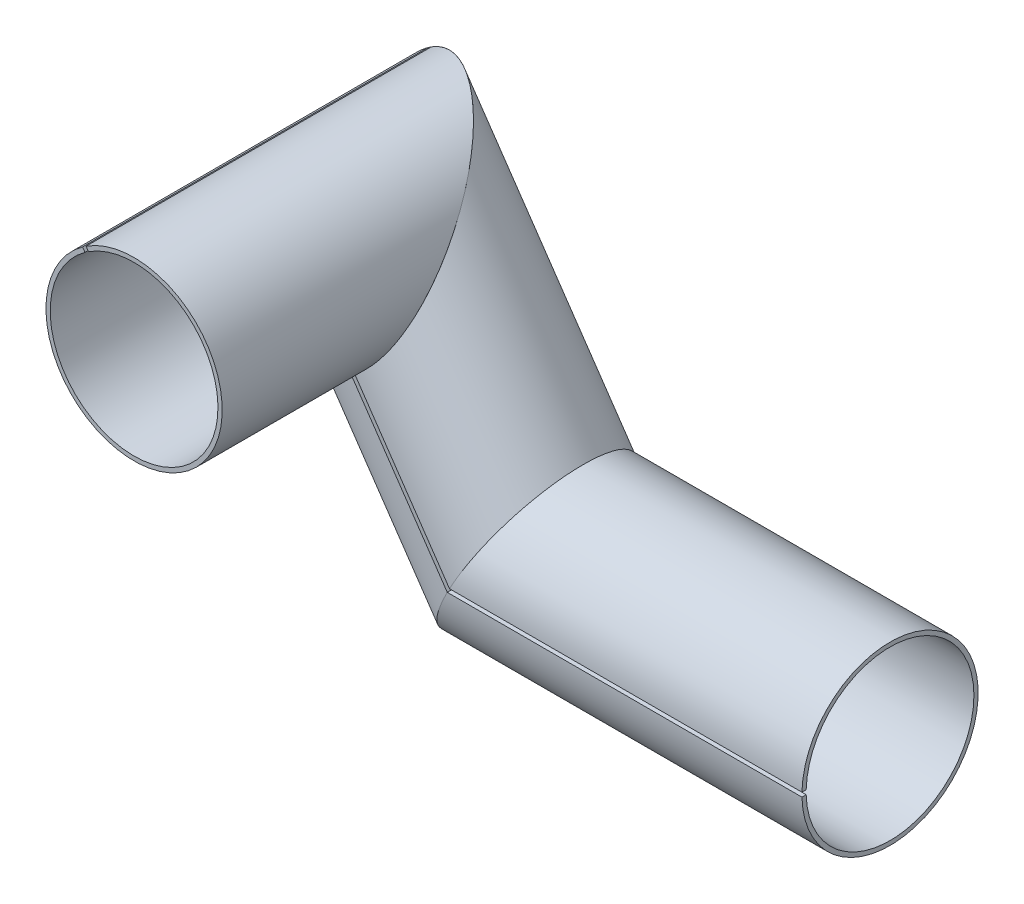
ISO-10303-21;
HEADER;
FILE_DESCRIPTION(('STEP AP214'),'2;1');
FILE_NAME('part.step','',(''),(''),'','','');
FILE_SCHEMA(('AUTOMOTIVE_DESIGN { 1 0 10303 214 1 1 1 1 }'));
ENDSEC;
DATA;
#1=APPLICATION_CONTEXT('core data for automotive mechanical design processes');
#2=APPLICATION_PROTOCOL_DEFINITION('international standard','automotive_design',2000,#1);
#3=PRODUCT_CONTEXT('',#1,'mechanical');
#4=PRODUCT('Part','Part','',(#3));
#5=PRODUCT_RELATED_PRODUCT_CATEGORY('part','',(#4));
#6=PRODUCT_DEFINITION_FORMATION('','',#4);
#7=PRODUCT_DEFINITION_CONTEXT('part definition',#1,'design');
#8=PRODUCT_DEFINITION('design','',#6,#7);
#9=PRODUCT_DEFINITION_SHAPE('','',#8);
#10=(LENGTH_UNIT() NAMED_UNIT(*) SI_UNIT(.MILLI.,.METRE.));
#11=(NAMED_UNIT(*) PLANE_ANGLE_UNIT() SI_UNIT($,.RADIAN.));
#12=(NAMED_UNIT(*) SI_UNIT($,.STERADIAN.) SOLID_ANGLE_UNIT());
#13=UNCERTAINTY_MEASURE_WITH_UNIT(LENGTH_MEASURE(1.E-05),#10,'distance_accuracy_value','');
#14=(GEOMETRIC_REPRESENTATION_CONTEXT(3) GLOBAL_UNCERTAINTY_ASSIGNED_CONTEXT((#13)) GLOBAL_UNIT_ASSIGNED_CONTEXT((#10,
#11,#12)) REPRESENTATION_CONTEXT('',''));
#15=CARTESIAN_POINT('',(0.,0.,0.));
#16=DIRECTION('',(0.,0.,1.));
#17=DIRECTION('',(1.,0.,0.));
#18=AXIS2_PLACEMENT_3D('',#15,#16,#17);
#19=CARTESIAN_POINT('',(-34.2580416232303,50.053168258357,60.65420899));
#20=DIRECTION('',(0.,0.,1.));
#21=DIRECTION('',(1.,0.,0.));
#22=AXIS2_PLACEMENT_3D('',#19,#20,#21);
#23=PLANE('',#22);
#24=DIRECTION('',(0.564808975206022,-0.825221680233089,0.));
#25=VECTOR('',#24,1.);
#26=CARTESIAN_POINT('',(-50.98980177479,73.6140743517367,60.65420899));
#27=LINE('',#26,#25);
#28=CARTESIAN_POINT('',(-46.4073916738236,66.9188830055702,60.65420899));
#29=VERTEX_POINT('',#28);
#30=CARTESIAN_POINT('',(-45.8424109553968,66.0934103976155,60.65420899));
#31=VERTEX_POINT('',#30);
#32=EDGE_CURVE('E124',#29,#31,#27,.T.);
#33=ORIENTED_EDGE('',*,*,#32,.F.);
#34=CARTESIAN_POINT('',(-34.2580416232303,50.053168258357,60.65420899));
#35=DIRECTION('',(0.,0.,1.));
#36=DIRECTION('',(1.,0.,0.));
#37=AXIS2_PLACEMENT_3D('',#34,#35,#36);
#38=CIRCLE('',#37,20.786029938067);
#39=CARTESIAN_POINT('',(-45.5821699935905,67.4836919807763,60.65420899));
#40=VERTEX_POINT('',#39);
#41=EDGE_CURVE('E130',#29,#40,#38,.T.);
#42=ORIENTED_EDGE('',*,*,#41,.T.);
#43=DIRECTION('',(0.564808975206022,-0.825221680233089,0.));
#44=VECTOR('',#43,1.);
#45=CARTESIAN_POINT('',(-50.1645800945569,74.1788833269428,60.65420899));
#46=LINE('',#45,#44);
#47=CARTESIAN_POINT('',(-45.0171892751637,66.6582193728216,60.65420899));
#48=VERTEX_POINT('',#47);
#49=EDGE_CURVE('E116',#40,#48,#46,.T.);
#50=ORIENTED_EDGE('',*,*,#49,.T.);
#51=CARTESIAN_POINT('',(-34.2580416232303,50.053168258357,60.65420899));
#52=DIRECTION('',(0.,0.,1.));
#53=DIRECTION('',(1.,0.,0.));
#54=AXIS2_PLACEMENT_3D('',#51,#52,#53);
#55=CIRCLE('',#54,19.786029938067);
#56=EDGE_CURVE('E136',#31,#48,#55,.T.);
#57=ORIENTED_EDGE('',*,*,#56,.F.);
#58=EDGE_LOOP('',(#33,#42,#50,#57));
#59=FACE_BOUND('',#58,.T.);
#60=ADVANCED_FACE('F78',(#59),#23,.T.);
#61=CARTESIAN_POINT('',(-34.2580416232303,50.053168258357,60.65420899));
#62=DIRECTION('',(0.,0.,-1.));
#63=DIRECTION('',(-1.,0.,0.));
#64=AXIS2_PLACEMENT_3D('',#61,#62,#63);
#65=CYLINDRICAL_SURFACE('',#64,20.786029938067);
#66=ORIENTED_EDGE('',*,*,#41,.F.);
#67=DIRECTION('',(0.,0.,-1.));
#68=VECTOR('',#67,1.);
#69=CARTESIAN_POINT('',(-46.4073916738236,66.9188830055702,60.65420899));
#70=LINE('',#69,#68);
#71=CARTESIAN_POINT('',(-46.4073916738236,66.9188830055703,-20.7800154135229));
#72=VERTEX_POINT('',#71);
#73=EDGE_CURVE('E149',#29,#72,#70,.T.);
#74=ORIENTED_EDGE('',*,*,#73,.T.);
#75=CARTESIAN_POINT('',(-34.2580416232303,50.053168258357,-3.7470027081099E-13));
#76=DIRECTION('',(-0.399380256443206,0.583519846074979,0.707106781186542));
#77=DIRECTION('',(-0.399380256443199,0.583519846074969,-0.707106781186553));
#78=AXIS2_PLACEMENT_3D('',#75,#76,#77);
#79=ELLIPSE('',#78,29.3958854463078,20.786029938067);
#80=CARTESIAN_POINT('',(-45.5821699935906,67.4836919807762,-20.7800154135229));
#81=VERTEX_POINT('',#80);
#82=EDGE_CURVE('E132',#72,#81,#79,.T.);
#83=ORIENTED_EDGE('',*,*,#82,.T.);
#84=DIRECTION('',(0.,0.,-1.));
#85=VECTOR('',#84,1.);
#86=CARTESIAN_POINT('',(-45.5821699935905,67.4836919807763,60.65420899));
#87=LINE('',#86,#85);
#88=EDGE_CURVE('E93',#40,#81,#87,.T.);
#89=ORIENTED_EDGE('',*,*,#88,.F.);
#90=EDGE_LOOP('',(#66,#74,#83,#89));
#91=FACE_BOUND('',#90,.T.);
#92=ADVANCED_FACE('F80',(#91),#65,.T.);
#93=CARTESIAN_POINT('',(-34.2580416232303,50.053168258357,60.65420899));
#94=DIRECTION('',(0.,0.,-1.));
#95=DIRECTION('',(-1.,0.,0.));
#96=AXIS2_PLACEMENT_3D('',#93,#94,#95);
#97=CYLINDRICAL_SURFACE('',#96,19.786029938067);
#98=DIRECTION('',(0.,0.,-1.));
#99=VECTOR('',#98,1.);
#100=CARTESIAN_POINT('',(-45.8424109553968,66.0934103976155,60.65420899));
#101=LINE('',#100,#99);
#102=CARTESIAN_POINT('',(-45.8424109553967,66.0934103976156,-19.7797113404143));
#103=VERTEX_POINT('',#102);
#104=EDGE_CURVE('E101',#31,#103,#101,.T.);
#105=ORIENTED_EDGE('',*,*,#104,.F.);
#106=ORIENTED_EDGE('',*,*,#56,.T.);
#107=DIRECTION('',(0.,0.,-1.));
#108=VECTOR('',#107,1.);
#109=CARTESIAN_POINT('',(-45.0171892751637,66.6582193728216,60.65420899));
#110=LINE('',#109,#108);
#111=CARTESIAN_POINT('',(-45.0171892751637,66.6582193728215,-19.7797113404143));
#112=VERTEX_POINT('',#111);
#113=EDGE_CURVE('E119',#48,#112,#110,.T.);
#114=ORIENTED_EDGE('',*,*,#113,.T.);
#115=CARTESIAN_POINT('',(-34.2580416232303,50.053168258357,-3.7470027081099E-13));
#116=DIRECTION('',(-0.399380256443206,0.583519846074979,0.707106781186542));
#117=DIRECTION('',(-0.399380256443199,0.583519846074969,-0.707106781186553));
#118=AXIS2_PLACEMENT_3D('',#115,#116,#117);
#119=ELLIPSE('',#118,27.9816718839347,19.786029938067);
#120=EDGE_CURVE('E135',#103,#112,#119,.T.);
#121=ORIENTED_EDGE('',*,*,#120,.F.);
#122=EDGE_LOOP('',(#105,#106,#114,#121));
#123=FACE_BOUND('',#122,.T.);
#124=ADVANCED_FACE('F145',(#123),#97,.F.);
#125=CARTESIAN_POINT('',(261.71806413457,179.128487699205,60.6542089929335));
#126=DIRECTION('',(-0.399380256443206,0.583519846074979,0.707106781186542));
#127=DIRECTION('',(0.,-0.771289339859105,0.636484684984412));
#128=AXIS2_PLACEMENT_3D('',#125,#126,#127);
#129=PLANE('',#128);
#130=ORIENTED_EDGE('',*,*,#82,.F.);
#131=DIRECTION('',(0.3993802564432,-0.583519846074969,0.707106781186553));
#132=VECTOR('',#131,1.);
#133=CARTESIAN_POINT('',(-0.412610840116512,-0.282404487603,60.6542089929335));
#134=LINE('',#133,#132);
#135=EDGE_CURVE('E13',#72,#103,#134,.T.);
#136=ORIENTED_EDGE('',*,*,#135,.T.);
#137=ORIENTED_EDGE('',*,*,#120,.T.);
#138=DIRECTION('',(0.3993802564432,-0.583519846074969,0.707106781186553));
#139=VECTOR('',#138,1.);
#140=CARTESIAN_POINT('',(0.412610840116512,0.282404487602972,60.6542089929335));
#141=LINE('',#140,#139);
#142=EDGE_CURVE('E86',#81,#112,#141,.T.);
#143=ORIENTED_EDGE('',*,*,#142,.F.);
#144=EDGE_LOOP('',(#130,#136,#137,#143));
#145=FACE_BOUND('',#144,.T.);
#146=ADVANCED_FACE('F147',(#145),#129,.F.);
#147=CARTESIAN_POINT('',(-50.1645800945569,74.1788833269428,0.));
#148=DIRECTION('',(-0.825221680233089,-0.564808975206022,0.));
#149=DIRECTION('',(0.564808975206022,-0.825221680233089,0.));
#150=AXIS2_PLACEMENT_3D('',#147,#148,#149);
#151=PLANE('',#150);
#152=ORIENTED_EDGE('',*,*,#88,.T.);
#153=ORIENTED_EDGE('',*,*,#142,.T.);
#154=ORIENTED_EDGE('',*,*,#113,.F.);
#155=ORIENTED_EDGE('',*,*,#49,.F.);
#156=EDGE_LOOP('',(#152,#153,#154,#155));
#157=FACE_BOUND('',#156,.T.);
#158=ADVANCED_FACE('F117',(#157),#151,.T.);
#159=CARTESIAN_POINT('',(-50.98980177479,73.6140743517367,0.));
#160=DIRECTION('',(-0.825221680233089,-0.564808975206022,0.));
#161=DIRECTION('',(0.564808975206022,-0.825221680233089,0.));
#162=AXIS2_PLACEMENT_3D('',#159,#160,#161);
#163=PLANE('',#162);
#164=ORIENTED_EDGE('',*,*,#32,.T.);
#165=ORIENTED_EDGE('',*,*,#104,.T.);
#166=ORIENTED_EDGE('',*,*,#135,.F.);
#167=ORIENTED_EDGE('',*,*,#73,.F.);
#168=EDGE_LOOP('',(#164,#165,#166,#167));
#169=FACE_BOUND('',#168,.T.);
#170=ADVANCED_FACE('F148',(#169),#163,.F.);
#171=CLOSED_SHELL('',(#60,#92,#124,#146,#158,#170));
#172=MANIFOLD_SOLID_BREP('B2',#171);
#173=CARTESIAN_POINT('',(6.19130841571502,-9.04589367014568,0.));
#174=DIRECTION('',(-0.564808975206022,0.825221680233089,0.));
#175=DIRECTION('',(-0.82522168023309,-0.564808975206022,0.));
#176=AXIS2_PLACEMENT_3D('',#173,#174,#175);
#177=CYLINDRICAL_SURFACE('',#176,20.786029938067);
#178=CARTESIAN_POINT('',(-34.2580416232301,50.0531682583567,0.));
#179=DIRECTION('',(-0.399380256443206,0.583519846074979,0.707106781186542));
#180=DIRECTION('',(-0.399380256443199,0.583519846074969,-0.707106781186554));
#181=AXIS2_PLACEMENT_3D('',#178,#179,#180);
#182=ELLIPSE('',#181,29.3958854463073,20.786029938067);
#183=CARTESIAN_POINT('',(-22.1086915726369,33.1874535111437,20.7800154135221));
#184=VERTEX_POINT('',#183);
#185=CARTESIAN_POINT('',(-22.93391325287,32.6226445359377,20.7800154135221));
#186=VERTEX_POINT('',#185);
#187=EDGE_CURVE('E276',#184,#186,#182,.T.);
#188=ORIENTED_EDGE('',*,*,#187,.F.);
#189=DIRECTION('',(-0.564808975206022,0.825221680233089,0.));
#190=VECTOR('',#189,1.);
#191=CARTESIAN_POINT('',(6.60391925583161,-8.76348918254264,20.7800154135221));
#192=LINE('',#191,#190);
#193=CARTESIAN_POINT('',(0.263681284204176,0.5,20.7800154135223));
#194=VERTEX_POINT('',#193);
#195=EDGE_CURVE('E230',#184,#194,#192,.F.);
#196=ORIENTED_EDGE('',*,*,#195,.T.);
#197=CARTESIAN_POINT('',(0.,0.,0.));
#198=DIRECTION('',(-0.88453631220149,0.46647134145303,0.));
#199=DIRECTION('',(0.46647134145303,0.88453631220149,0.));
#200=AXIS2_PLACEMENT_3D('',#197,#198,#199);
#201=ELLIPSE('',#200,23.499351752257,20.786029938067);
#202=CARTESIAN_POINT('',(-0.263681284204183,-0.5,20.7800154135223));
#203=VERTEX_POINT('',#202);
#204=EDGE_CURVE('E269',#194,#203,#201,.T.);
#205=ORIENTED_EDGE('',*,*,#204,.T.);
#206=DIRECTION('',(-0.564808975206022,0.825221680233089,0.));
#207=VECTOR('',#206,1.);
#208=CARTESIAN_POINT('',(5.77869757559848,-9.32829815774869,20.7800154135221));
#209=LINE('',#208,#207);
#210=EDGE_CURVE('E254',#186,#203,#209,.F.);
#211=ORIENTED_EDGE('',*,*,#210,.F.);
#212=EDGE_LOOP('',(#188,#196,#205,#211));
#213=FACE_BOUND('',#212,.T.);
#214=ADVANCED_FACE('F217',(#213),#177,.T.);
#215=CARTESIAN_POINT('',(6.19130841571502,-9.04589367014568,0.));
#216=DIRECTION('',(-0.564808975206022,0.825221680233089,0.));
#217=DIRECTION('',(-0.82522168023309,-0.564808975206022,0.));
#218=AXIS2_PLACEMENT_3D('',#215,#216,#217);
#219=CYLINDRICAL_SURFACE('',#218,19.786029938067);
#220=DIRECTION('',(-0.564808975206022,0.825221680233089,0.));
#221=VECTOR('',#220,1.);
#222=CARTESIAN_POINT('',(6.60391925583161,-8.76348918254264,19.7797113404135));
#223=LINE('',#222,#221);
#224=CARTESIAN_POINT('',(-22.6736722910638,34.0129261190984,19.7797113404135));
#225=VERTEX_POINT('',#224);
#226=CARTESIAN_POINT('',(0.263681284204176,0.5,19.7797113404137));
#227=VERTEX_POINT('',#226);
#228=EDGE_CURVE('E262',#225,#227,#223,.F.);
#229=ORIENTED_EDGE('',*,*,#228,.F.);
#230=CARTESIAN_POINT('',(-34.2580416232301,50.0531682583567,0.));
#231=DIRECTION('',(-0.399380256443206,0.583519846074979,0.707106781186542));
#232=DIRECTION('',(-0.399380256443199,0.583519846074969,-0.707106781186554));
#233=AXIS2_PLACEMENT_3D('',#230,#231,#232);
#234=ELLIPSE('',#233,27.9816718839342,19.786029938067);
#235=CARTESIAN_POINT('',(-23.4988939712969,33.4481171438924,19.7797113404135));
#236=VERTEX_POINT('',#235);
#237=EDGE_CURVE('E274',#225,#236,#234,.T.);
#238=ORIENTED_EDGE('',*,*,#237,.T.);
#239=DIRECTION('',(-0.564808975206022,0.825221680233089,0.));
#240=VECTOR('',#239,1.);
#241=CARTESIAN_POINT('',(5.77869757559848,-9.32829815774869,19.7797113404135));
#242=LINE('',#241,#240);
#243=CARTESIAN_POINT('',(-0.263681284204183,-0.5,19.7797113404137));
#244=VERTEX_POINT('',#243);
#245=EDGE_CURVE('E238',#236,#244,#242,.F.);
#246=ORIENTED_EDGE('',*,*,#245,.T.);
#247=CARTESIAN_POINT('',(0.,0.,0.));
#248=DIRECTION('',(-0.88453631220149,0.46647134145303,0.));
#249=DIRECTION('',(0.46647134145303,0.88453631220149,0.));
#250=AXIS2_PLACEMENT_3D('',#247,#248,#249);
#251=ELLIPSE('',#250,22.3688159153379,19.786029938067);
#252=EDGE_CURVE('E271',#227,#244,#251,.T.);
#253=ORIENTED_EDGE('',*,*,#252,.F.);
#254=EDGE_LOOP('',(#229,#238,#246,#253));
#255=FACE_BOUND('',#254,.T.);
#256=ADVANCED_FACE('F288',(#255),#219,.F.);
#257=CARTESIAN_POINT('',(-10.9617741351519,-20.786029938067,329.872407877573));
#258=DIRECTION('',(-0.88453631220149,0.46647134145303,0.));
#259=DIRECTION('',(-0.46647134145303,-0.88453631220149,0.));
#260=AXIS2_PLACEMENT_3D('',#257,#258,#259);
#261=PLANE('',#260);
#262=ORIENTED_EDGE('',*,*,#204,.F.);
#263=DIRECTION('',(0.,0.,-1.));
#264=VECTOR('',#263,1.);
#265=CARTESIAN_POINT('',(0.263681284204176,0.5,60.65420899));
#266=LINE('',#265,#264);
#267=EDGE_CURVE('E272',#194,#227,#266,.T.);
#268=ORIENTED_EDGE('',*,*,#267,.T.);
#269=ORIENTED_EDGE('',*,*,#252,.T.);
#270=DIRECTION('',(0.,0.,-1.));
#271=VECTOR('',#270,1.);
#272=CARTESIAN_POINT('',(-0.263681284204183,-0.5,60.65420899));
#273=LINE('',#272,#271);
#274=EDGE_CURVE('E257',#203,#244,#273,.T.);
#275=ORIENTED_EDGE('',*,*,#274,.F.);
#276=EDGE_LOOP('',(#262,#268,#269,#275));
#277=FACE_BOUND('',#276,.T.);
#278=ADVANCED_FACE('F267',(#277),#261,.F.);
#279=CARTESIAN_POINT('',(280.632861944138,192.074400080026,60.6542089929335));
#280=DIRECTION('',(-0.399380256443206,0.583519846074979,0.707106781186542));
#281=DIRECTION('',(0.,-0.771289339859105,0.636484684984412));
#282=AXIS2_PLACEMENT_3D('',#279,#280,#281);
#283=PLANE('',#282);
#284=DIRECTION('',(-0.3993802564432,0.583519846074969,-0.707106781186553));
#285=VECTOR('',#284,1.);
#286=CARTESIAN_POINT('',(0.412610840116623,0.282404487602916,60.6542089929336));
#287=LINE('',#286,#285);
#288=EDGE_CURVE('E76',#184,#225,#287,.T.);
#289=ORIENTED_EDGE('',*,*,#288,.F.);
#290=ORIENTED_EDGE('',*,*,#187,.T.);
#291=DIRECTION('',(-0.399380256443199,0.583519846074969,-0.707106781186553));
#292=VECTOR('',#291,1.);
#293=CARTESIAN_POINT('',(-0.412610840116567,-0.282404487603,60.6542089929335));
#294=LINE('',#293,#292);
#295=EDGE_CURVE('E224',#186,#236,#294,.T.);
#296=ORIENTED_EDGE('',*,*,#295,.T.);
#297=ORIENTED_EDGE('',*,*,#237,.F.);
#298=EDGE_LOOP('',(#289,#290,#296,#297));
#299=FACE_BOUND('',#298,.T.);
#300=ADVANCED_FACE('F284',(#299),#283,.T.);
#301=CARTESIAN_POINT('',(-34.6706524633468,49.770763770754,60.65420899));
#302=DIRECTION('',(0.825221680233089,0.564808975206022,0.));
#303=DIRECTION('',(-0.564808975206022,0.825221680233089,0.));
#304=AXIS2_PLACEMENT_3D('',#301,#302,#303);
#305=PLANE('',#304);
#306=ORIENTED_EDGE('',*,*,#210,.T.);
#307=ORIENTED_EDGE('',*,*,#274,.T.);
#308=ORIENTED_EDGE('',*,*,#245,.F.);
#309=ORIENTED_EDGE('',*,*,#295,.F.);
#310=EDGE_LOOP('',(#306,#307,#308,#309));
#311=FACE_BOUND('',#310,.T.);
#312=ADVANCED_FACE('F256',(#311),#305,.T.);
#313=CARTESIAN_POINT('',(-33.8454307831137,50.33557274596,60.65420899));
#314=DIRECTION('',(0.825221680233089,0.564808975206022,0.));
#315=DIRECTION('',(-0.564808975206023,0.825221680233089,0.));
#316=AXIS2_PLACEMENT_3D('',#313,#314,#315);
#317=PLANE('',#316);
#318=ORIENTED_EDGE('',*,*,#288,.T.);
#319=ORIENTED_EDGE('',*,*,#228,.T.);
#320=ORIENTED_EDGE('',*,*,#267,.F.);
#321=ORIENTED_EDGE('',*,*,#195,.F.);
#322=EDGE_LOOP('',(#318,#319,#320,#321));
#323=FACE_BOUND('',#322,.T.);
#324=ADVANCED_FACE('F286',(#323),#317,.F.);
#325=CLOSED_SHELL('',(#214,#256,#278,#300,#312,#324));
#326=MANIFOLD_SOLID_BREP('B7',#325);
#327=CARTESIAN_POINT('',(83.3860984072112,0.,0.));
#328=DIRECTION('',(-1.,0.,0.));
#329=DIRECTION('',(0.,0.,1.));
#330=AXIS2_PLACEMENT_3D('',#327,#328,#329);
#331=CYLINDRICAL_SURFACE('',#330,20.786029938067);
#332=DIRECTION('',(-1.,0.,0.));
#333=VECTOR('',#332,1.);
#334=CARTESIAN_POINT('',(83.3860984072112,-0.5,20.7800154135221));
#335=LINE('',#334,#333);
#336=CARTESIAN_POINT('',(-0.263681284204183,-0.5,20.7800154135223));
#337=VERTEX_POINT('',#336);
#338=CARTESIAN_POINT('',(83.3860984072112,-0.5,20.7800154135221));
#339=VERTEX_POINT('',#338);
#340=EDGE_CURVE('E385',#337,#339,#335,.F.);
#341=ORIENTED_EDGE('',*,*,#340,.F.);
#342=CARTESIAN_POINT('',(0.,0.,0.));
#343=DIRECTION('',(-0.88453631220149,0.46647134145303,0.));
#344=DIRECTION('',(-0.46647134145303,-0.88453631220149,0.));
#345=AXIS2_PLACEMENT_3D('',#342,#343,#344);
#346=ELLIPSE('',#345,23.499351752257,20.786029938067);
#347=CARTESIAN_POINT('',(0.263681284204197,0.500000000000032,20.7800154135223));
#348=VERTEX_POINT('',#347);
#349=EDGE_CURVE('E395',#348,#337,#346,.T.);
#350=ORIENTED_EDGE('',*,*,#349,.F.);
#351=DIRECTION('',(-1.,0.,0.));
#352=VECTOR('',#351,1.);
#353=CARTESIAN_POINT('',(83.3860984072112,0.5,20.7800154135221));
#354=LINE('',#353,#352);
#355=CARTESIAN_POINT('',(83.3860984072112,0.5,20.7800154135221));
#356=VERTEX_POINT('',#355);
#357=EDGE_CURVE('E360',#348,#356,#354,.F.);
#358=ORIENTED_EDGE('',*,*,#357,.T.);
#359=CARTESIAN_POINT('',(83.3860984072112,0.,0.));
#360=DIRECTION('',(1.,0.,0.));
#361=DIRECTION('',(0.,0.,-1.));
#362=AXIS2_PLACEMENT_3D('',#359,#360,#361);
#363=CIRCLE('',#362,20.786029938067);
#364=EDGE_CURVE('E391',#339,#356,#363,.T.);
#365=ORIENTED_EDGE('',*,*,#364,.F.);
#366=EDGE_LOOP('',(#341,#350,#358,#365));
#367=FACE_BOUND('',#366,.T.);
#368=ADVANCED_FACE('F347',(#367),#331,.T.);
#369=CARTESIAN_POINT('',(83.3860984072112,0.,0.));
#370=DIRECTION('',(-1.,0.,0.));
#371=DIRECTION('',(0.,0.,1.));
#372=AXIS2_PLACEMENT_3D('',#369,#370,#371);
#373=CYLINDRICAL_SURFACE('',#372,19.786029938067);
#374=CARTESIAN_POINT('',(0.,0.,0.));
#375=DIRECTION('',(-0.88453631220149,0.46647134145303,0.));
#376=DIRECTION('',(-0.46647134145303,-0.88453631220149,0.));
#377=AXIS2_PLACEMENT_3D('',#374,#375,#376);
#378=ELLIPSE('',#377,22.3688159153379,19.786029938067);
#379=CARTESIAN_POINT('',(0.263681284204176,0.5,19.7797113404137));
#380=VERTEX_POINT('',#379);
#381=CARTESIAN_POINT('',(-0.263681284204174,-0.500000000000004,19.7797113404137));
#382=VERTEX_POINT('',#381);
#383=EDGE_CURVE('E397',#380,#382,#378,.T.);
#384=ORIENTED_EDGE('',*,*,#383,.T.);
#385=DIRECTION('',(-1.,0.,0.));
#386=VECTOR('',#385,1.);
#387=CARTESIAN_POINT('',(83.3860984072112,-0.5,19.7797113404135));
#388=LINE('',#387,#386);
#389=CARTESIAN_POINT('',(83.3860984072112,-0.5,19.7797113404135));
#390=VERTEX_POINT('',#389);
#391=EDGE_CURVE('E368',#382,#390,#388,.F.);
#392=ORIENTED_EDGE('',*,*,#391,.T.);
#393=CARTESIAN_POINT('',(83.3860984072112,0.,0.));
#394=DIRECTION('',(1.,0.,0.));
#395=DIRECTION('',(0.,0.,-1.));
#396=AXIS2_PLACEMENT_3D('',#393,#394,#395);
#397=CIRCLE('',#396,19.786029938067);
#398=CARTESIAN_POINT('',(83.3860984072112,0.5,19.7797113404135));
#399=VERTEX_POINT('',#398);
#400=EDGE_CURVE('E400',#390,#399,#397,.T.);
#401=ORIENTED_EDGE('',*,*,#400,.T.);
#402=DIRECTION('',(-1.,0.,0.));
#403=VECTOR('',#402,1.);
#404=CARTESIAN_POINT('',(83.3860984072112,0.5,19.7797113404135));
#405=LINE('',#404,#403);
#406=EDGE_CURVE('E412',#380,#399,#405,.F.);
#407=ORIENTED_EDGE('',*,*,#406,.F.);
#408=EDGE_LOOP('',(#384,#392,#401,#407));
#409=FACE_BOUND('',#408,.T.);
#410=ADVANCED_FACE('F419',(#409),#373,.F.);
#411=CARTESIAN_POINT('',(83.3860984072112,0.,0.));
#412=DIRECTION('',(1.,0.,0.));
#413=DIRECTION('',(0.,0.,-1.));
#414=AXIS2_PLACEMENT_3D('',#411,#412,#413);
#415=PLANE('',#414);
#416=ORIENTED_EDGE('',*,*,#400,.F.);
#417=DIRECTION('',(0.,0.,-1.));
#418=VECTOR('',#417,1.);
#419=CARTESIAN_POINT('',(83.3860984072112,-0.5,60.65420899));
#420=LINE('',#419,#418);
#421=EDGE_CURVE('E411',#339,#390,#420,.T.);
#422=ORIENTED_EDGE('',*,*,#421,.F.);
#423=ORIENTED_EDGE('',*,*,#364,.T.);
#424=DIRECTION('',(0.,0.,-1.));
#425=VECTOR('',#424,1.);
#426=CARTESIAN_POINT('',(83.3860984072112,0.5,60.65420899));
#427=LINE('',#426,#425);
#428=EDGE_CURVE('E410',#356,#399,#427,.T.);
#429=ORIENTED_EDGE('',*,*,#428,.T.);
#430=EDGE_LOOP('',(#416,#422,#423,#429));
#431=FACE_BOUND('',#430,.T.);
#432=ADVANCED_FACE('F409',(#431),#415,.T.);
#433=CARTESIAN_POINT('',(-10.9617741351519,-20.786029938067,329.872407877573));
#434=DIRECTION('',(-0.88453631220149,0.46647134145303,0.));
#435=DIRECTION('',(-0.46647134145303,-0.88453631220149,0.));
#436=AXIS2_PLACEMENT_3D('',#433,#434,#435);
#437=PLANE('',#436);
#438=DIRECTION('',(0.,0.,-1.));
#439=VECTOR('',#438,1.);
#440=CARTESIAN_POINT('',(0.263681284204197,0.500000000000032,329.872407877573));
#441=LINE('',#440,#439);
#442=EDGE_CURVE('E215',#348,#380,#441,.T.);
#443=ORIENTED_EDGE('',*,*,#442,.F.);
#444=ORIENTED_EDGE('',*,*,#349,.T.);
#445=DIRECTION('',(0.,0.,-1.));
#446=VECTOR('',#445,1.);
#447=CARTESIAN_POINT('',(-0.263681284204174,-0.500000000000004,329.872407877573));
#448=LINE('',#447,#446);
#449=EDGE_CURVE('E354',#337,#382,#448,.T.);
#450=ORIENTED_EDGE('',*,*,#449,.T.);
#451=ORIENTED_EDGE('',*,*,#383,.F.);
#452=EDGE_LOOP('',(#443,#444,#450,#451));
#453=FACE_BOUND('',#452,.T.);
#454=ADVANCED_FACE('F399',(#453),#437,.T.);
#455=CARTESIAN_POINT('',(0.,-0.5,60.65420899));
#456=DIRECTION('',(0.,1.,0.));
#457=DIRECTION('',(0.,0.,1.));
#458=AXIS2_PLACEMENT_3D('',#455,#456,#457);
#459=PLANE('',#458);
#460=ORIENTED_EDGE('',*,*,#340,.T.);
#461=ORIENTED_EDGE('',*,*,#421,.T.);
#462=ORIENTED_EDGE('',*,*,#391,.F.);
#463=ORIENTED_EDGE('',*,*,#449,.F.);
#464=EDGE_LOOP('',(#460,#461,#462,#463));
#465=FACE_BOUND('',#464,.T.);
#466=ADVANCED_FACE('F384',(#465),#459,.T.);
#467=CARTESIAN_POINT('',(0.,0.5,60.65420899));
#468=DIRECTION('',(0.,1.,0.));
#469=DIRECTION('',(0.,0.,1.));
#470=AXIS2_PLACEMENT_3D('',#467,#468,#469);
#471=PLANE('',#470);
#472=ORIENTED_EDGE('',*,*,#442,.T.);
#473=ORIENTED_EDGE('',*,*,#406,.T.);
#474=ORIENTED_EDGE('',*,*,#428,.F.);
#475=ORIENTED_EDGE('',*,*,#357,.F.);
#476=EDGE_LOOP('',(#472,#473,#474,#475));
#477=FACE_BOUND('',#476,.T.);
#478=ADVANCED_FACE('F421',(#477),#471,.F.);
#479=CLOSED_SHELL('',(#368,#410,#432,#454,#466,#478));
#480=MANIFOLD_SOLID_BREP('B70',#479);
#481=ADVANCED_BREP_SHAPE_REPRESENTATION('',(#18,#172,#326,#480),#14);
#482=SHAPE_DEFINITION_REPRESENTATION(#9,#481);
ENDSEC;
END-ISO-10303-21;
